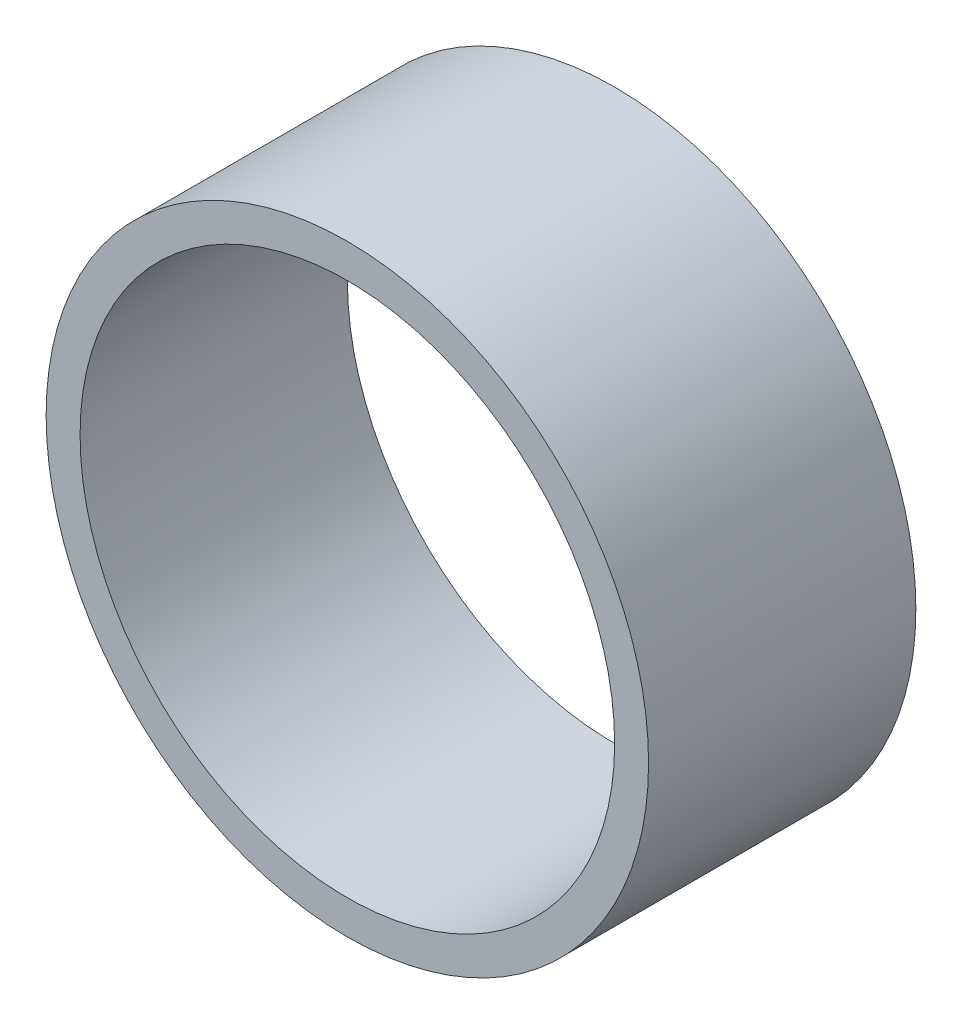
from build123d import *

# Parameters (mm, degrees)
SKETCH1_R      = 14.3129
SKETCH1_R_2    = 12.7
EXTRUDE1_DEPTH = 6.35


with BuildPart() as part:
    # Sketch1 → Extrude1 (new, symmetric)
    with BuildSketch(Plane.XY):
        Circle(SKETCH1_R)
        Circle(SKETCH1_R_2, mode=Mode.SUBTRACT)
    extrude(amount=EXTRUDE1_DEPTH, both=True)


solid = part.part
